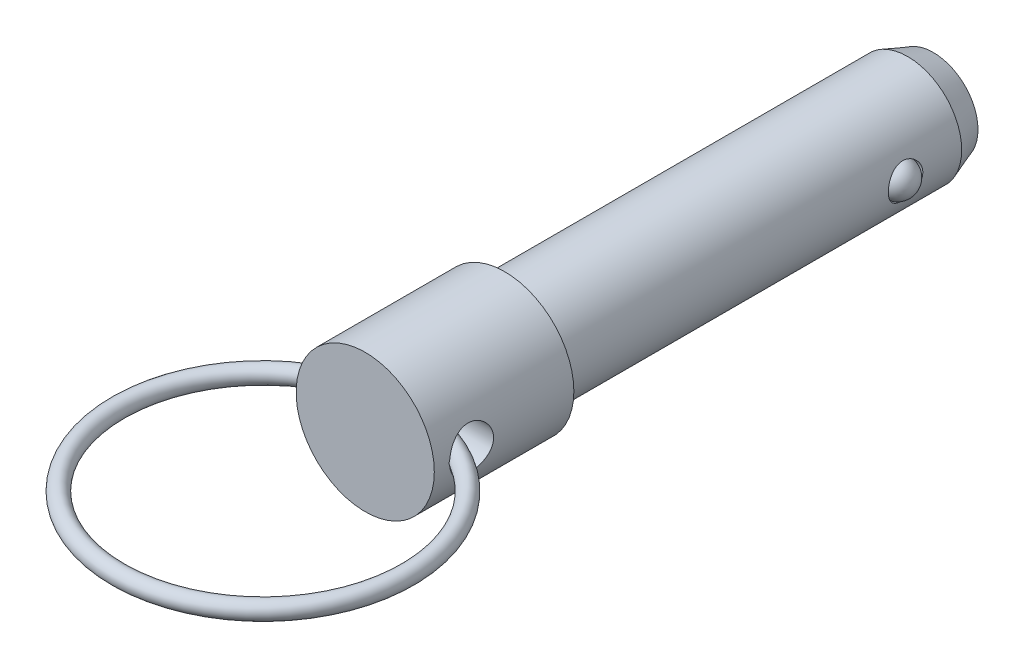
ISO-10303-21;
HEADER;
FILE_DESCRIPTION(('STEP AP214'),'2;1');
FILE_NAME('part.step','',(''),(''),'','','');
FILE_SCHEMA(('AUTOMOTIVE_DESIGN { 1 0 10303 214 1 1 1 1 }'));
ENDSEC;
DATA;
#1=APPLICATION_CONTEXT('core data for automotive mechanical design processes');
#2=APPLICATION_PROTOCOL_DEFINITION('international standard','automotive_design',2000,#1);
#3=PRODUCT_CONTEXT('',#1,'mechanical');
#4=PRODUCT('Part','Part','',(#3));
#5=PRODUCT_RELATED_PRODUCT_CATEGORY('part','',(#4));
#6=PRODUCT_DEFINITION_FORMATION('','',#4);
#7=PRODUCT_DEFINITION_CONTEXT('part definition',#1,'design');
#8=PRODUCT_DEFINITION('design','',#6,#7);
#9=PRODUCT_DEFINITION_SHAPE('','',#8);
#10=(LENGTH_UNIT() NAMED_UNIT(*) SI_UNIT(.MILLI.,.METRE.));
#11=(NAMED_UNIT(*) PLANE_ANGLE_UNIT() SI_UNIT($,.RADIAN.));
#12=(NAMED_UNIT(*) SI_UNIT($,.STERADIAN.) SOLID_ANGLE_UNIT());
#13=UNCERTAINTY_MEASURE_WITH_UNIT(LENGTH_MEASURE(1.E-05),#10,'distance_accuracy_value','');
#14=(GEOMETRIC_REPRESENTATION_CONTEXT(3) GLOBAL_UNCERTAINTY_ASSIGNED_CONTEXT((#13)) GLOBAL_UNIT_ASSIGNED_CONTEXT((#10,
#11,#12)) REPRESENTATION_CONTEXT('',''));
#15=CARTESIAN_POINT('',(0.,0.,0.));
#16=DIRECTION('',(0.,0.,1.));
#17=DIRECTION('',(1.,0.,0.));
#18=AXIS2_PLACEMENT_3D('',#15,#16,#17);
#19=CARTESIAN_POINT('',(7.9375,0.,9.398));
#20=DIRECTION('',(-1.,0.,0.));
#21=DIRECTION('',(0.,0.,-1.));
#22=AXIS2_PLACEMENT_3D('',#19,#20,#21);
#23=CYLINDRICAL_SURFACE('',#22,2.0193);
#24=CARTESIAN_POINT('',(-6.3502,0.292157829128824,11.3960531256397));
#25=CARTESIAN_POINT('',(-6.33446408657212,0.262361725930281,11.4004344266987));
#26=CARTESIAN_POINT('',(-6.32102794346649,0.23122551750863,11.4042829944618));
#27=CARTESIAN_POINT('',(-6.29925234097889,0.167152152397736,11.4106204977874));
#28=CARTESIAN_POINT('',(-6.29090461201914,0.134218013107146,11.413111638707));
#29=CARTESIAN_POINT('',(-6.2797291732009,0.0672091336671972,11.4164621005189));
#30=CARTESIAN_POINT('',(-6.27692077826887,0.0331308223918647,11.4173157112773));
#31=CARTESIAN_POINT('',(-6.2770260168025,-0.0350157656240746,11.4172838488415));
#32=CARTESIAN_POINT('',(-6.27993956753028,-0.069084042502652,11.4163984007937));
#33=CARTESIAN_POINT('',(-6.29126629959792,-0.135748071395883,11.4130038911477));
#34=CARTESIAN_POINT('',(-6.29960976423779,-0.168356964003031,11.4105154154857));
#35=CARTESIAN_POINT('',(-6.32127848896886,-0.231802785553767,11.404211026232));
#36=CARTESIAN_POINT('',(-6.33461136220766,-0.262636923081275,11.4003930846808));
#37=CARTESIAN_POINT('',(-6.3502,-0.292157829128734,11.3960531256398));
#38=B_SPLINE_CURVE_WITH_KNOTS('',3,(#24,#25,#26,#27,#28,#29,#30,#31,#32,#33,#34,#35,#36,#37),
.UNSPECIFIED.,.F.,.F.,(4,2,2,2,2,2,4),(0.,0.101899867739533,0.2036336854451,0.305721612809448,
0.407808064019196,0.508608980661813,0.609564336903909),.UNSPECIFIED.);
#39=CARTESIAN_POINT('',(-6.3438349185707,0.279747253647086,11.3978284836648));
#40=VERTEX_POINT('',#39);
#41=CARTESIAN_POINT('',(-6.3438349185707,-0.279747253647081,11.3978284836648));
#42=VERTEX_POINT('',#41);
#43=EDGE_CURVE('E40',#40,#42,#38,.T.);
#44=ORIENTED_EDGE('',*,*,#43,.F.);
#45=CARTESIAN_POINT('',(-6.35,0.,11.4173));
#46=CARTESIAN_POINT('',(-6.34999578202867,-0.110312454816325,11.417293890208));
#47=CARTESIAN_POINT('',(-6.34709412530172,-0.220741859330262,11.4082188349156));
#48=CARTESIAN_POINT('',(-6.3357852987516,-0.438477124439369,11.3722159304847));
#49=CARTESIAN_POINT('',(-6.3273687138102,-0.545777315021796,11.3452575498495));
#50=CARTESIAN_POINT('',(-6.30595235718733,-0.753914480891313,11.2744960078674));
#51=CARTESIAN_POINT('',(-6.29296259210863,-0.854765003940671,11.2307296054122));
#52=CARTESIAN_POINT('',(-6.26374009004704,-1.04765917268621,11.1277235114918));
#53=CARTESIAN_POINT('',(-6.247507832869,-1.13970411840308,11.0684861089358));
#54=CARTESIAN_POINT('',(-6.21293601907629,-1.31536123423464,10.9342184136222));
#55=CARTESIAN_POINT('',(-6.19454917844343,-1.39865352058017,10.8587818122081));
#56=CARTESIAN_POINT('',(-6.15801023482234,-1.55164747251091,10.6951184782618));
#57=CARTESIAN_POINT('',(-6.13985819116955,-1.62134576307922,10.606888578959));
#58=CARTESIAN_POINT('',(-6.1053372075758,-1.74691684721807,10.4173629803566));
#59=CARTESIAN_POINT('',(-6.08902613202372,-1.80238797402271,10.315789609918));
#60=CARTESIAN_POINT('',(-6.06074349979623,-1.89532725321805,10.104153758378));
#61=CARTESIAN_POINT('',(-6.0487707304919,-1.93280043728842,9.99409365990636));
#62=CARTESIAN_POINT('',(-6.03101341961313,-1.9875076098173,9.77220930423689));
#63=CARTESIAN_POINT('',(-6.02504825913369,-2.00533395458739,9.66054596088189));
#64=CARTESIAN_POINT('',(-6.01944581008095,-2.02209234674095,9.43566621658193));
#65=CARTESIAN_POINT('',(-6.01980677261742,-2.02102961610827,9.32245025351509));
#66=CARTESIAN_POINT('',(-6.02665663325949,-2.00050250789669,9.10261826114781));
#67=CARTESIAN_POINT('',(-6.03289303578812,-1.98179631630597,8.99592223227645));
#68=CARTESIAN_POINT('',(-6.05038018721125,-1.92774435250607,8.78726894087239));
#69=CARTESIAN_POINT('',(-6.06163151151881,-1.89239667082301,8.68531222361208));
#70=CARTESIAN_POINT('',(-6.08807105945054,-1.80553890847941,8.48724541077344));
#71=CARTESIAN_POINT('',(-6.1033159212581,-1.75379385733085,8.39124624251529));
#72=CARTESIAN_POINT('',(-6.13599834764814,-1.63577635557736,8.20905256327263));
#73=CARTESIAN_POINT('',(-6.15343637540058,-1.56950083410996,8.12286013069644));
#74=CARTESIAN_POINT('',(-6.18954615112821,-1.42061516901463,7.95845350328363));
#75=CARTESIAN_POINT('',(-6.2082373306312,-1.33738288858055,7.88080597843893));
#76=CARTESIAN_POINT('',(-6.24403204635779,-1.15881168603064,7.74040227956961));
#77=CARTESIAN_POINT('',(-6.26113489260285,-1.0634675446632,7.67765255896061));
#78=CARTESIAN_POINT('',(-6.29201953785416,-0.862230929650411,7.56842117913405));
#79=CARTESIAN_POINT('',(-6.30576997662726,-0.756251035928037,7.52209142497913));
#80=CARTESIAN_POINT('',(-6.32815272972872,-0.537579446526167,7.44816775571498));
#81=CARTESIAN_POINT('',(-6.3367955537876,-0.424902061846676,7.4205353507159));
#82=CARTESIAN_POINT('',(-6.34491251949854,-0.259333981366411,7.39474486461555));
#83=CARTESIAN_POINT('',(-6.3468148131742,-0.207677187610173,7.38873516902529));
#84=CARTESIAN_POINT('',(-6.34935954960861,-0.104022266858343,7.38071129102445));
#85=CARTESIAN_POINT('',(-6.35000198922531,-0.0520241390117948,7.37869711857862));
#86=CARTESIAN_POINT('',(-6.34999578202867,0.110312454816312,7.37870610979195));
#87=CARTESIAN_POINT('',(-6.34709412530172,0.22074185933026,7.38778116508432));
#88=CARTESIAN_POINT('',(-6.3357852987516,0.438477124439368,7.4237840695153));
#89=CARTESIAN_POINT('',(-6.3273687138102,0.545777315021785,7.45074245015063));
#90=CARTESIAN_POINT('',(-6.30595235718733,0.75391448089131,7.52150399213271));
#91=CARTESIAN_POINT('',(-6.29296259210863,0.854765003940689,7.56527039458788));
#92=CARTESIAN_POINT('',(-6.26374009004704,1.04765917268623,7.66827648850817));
#93=CARTESIAN_POINT('',(-6.247507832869,1.13970411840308,7.72751389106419));
#94=CARTESIAN_POINT('',(-6.21293601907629,1.31536123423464,7.86178158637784));
#95=CARTESIAN_POINT('',(-6.19454917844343,1.39865352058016,7.93721818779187));
#96=CARTESIAN_POINT('',(-6.15801023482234,1.55164747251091,8.10088152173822));
#97=CARTESIAN_POINT('',(-6.13985819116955,1.62134576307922,8.18911142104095));
#98=CARTESIAN_POINT('',(-6.1053372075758,1.74691684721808,8.37863701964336));
#99=CARTESIAN_POINT('',(-6.08902613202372,1.80238797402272,8.48021039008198));
#100=CARTESIAN_POINT('',(-6.06074349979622,1.89532725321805,8.69184624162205));
#101=CARTESIAN_POINT('',(-6.0487707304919,1.93280043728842,8.80190634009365));
#102=CARTESIAN_POINT('',(-6.03101341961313,1.9875076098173,9.02379069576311));
#103=CARTESIAN_POINT('',(-6.02504825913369,2.00533395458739,9.13545403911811));
#104=CARTESIAN_POINT('',(-6.01944581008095,2.02209234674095,9.36033378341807));
#105=CARTESIAN_POINT('',(-6.01980677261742,2.02102961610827,9.47354974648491));
#106=CARTESIAN_POINT('',(-6.02665663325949,2.00050250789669,9.69338173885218));
#107=CARTESIAN_POINT('',(-6.03289303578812,1.98179631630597,9.80007776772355));
#108=CARTESIAN_POINT('',(-6.05038018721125,1.92774435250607,10.0087310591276));
#109=CARTESIAN_POINT('',(-6.06163151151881,1.89239667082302,10.1106877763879));
#110=CARTESIAN_POINT('',(-6.08807105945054,1.80553890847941,10.3087545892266));
#111=CARTESIAN_POINT('',(-6.1033159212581,1.75379385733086,10.4047537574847));
#112=CARTESIAN_POINT('',(-6.13599834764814,1.63577635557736,10.5869474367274));
#113=CARTESIAN_POINT('',(-6.15343637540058,1.56950083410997,10.6731398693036));
#114=CARTESIAN_POINT('',(-6.18954615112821,1.42061516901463,10.8375464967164));
#115=CARTESIAN_POINT('',(-6.20823733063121,1.33738288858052,10.9151940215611));
#116=CARTESIAN_POINT('',(-6.2440320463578,1.15881168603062,11.0555977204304));
#117=CARTESIAN_POINT('',(-6.26113489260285,1.06346754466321,11.1183474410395));
#118=CARTESIAN_POINT('',(-6.29201953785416,0.862230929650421,11.227578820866));
#119=CARTESIAN_POINT('',(-6.30576997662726,0.756251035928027,11.2739085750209));
#120=CARTESIAN_POINT('',(-6.32815272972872,0.53757944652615,11.347832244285));
#121=CARTESIAN_POINT('',(-6.3367955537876,0.424902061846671,11.3754646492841));
#122=CARTESIAN_POINT('',(-6.34491251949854,0.25933398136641,11.4012551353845));
#123=CARTESIAN_POINT('',(-6.3468148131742,0.207677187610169,11.4072648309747));
#124=CARTESIAN_POINT('',(-6.34935954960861,0.104022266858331,11.4152887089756));
#125=CARTESIAN_POINT('',(-6.35000198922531,0.0520241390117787,11.4173028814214));
#126=CARTESIAN_POINT('',(-6.35,0.,11.4173));
#127=B_SPLINE_CURVE_WITH_KNOTS('',3,(#45,#46,#47,#48,#49,#50,#51,#52,#53,#54,#55,#56,#57,#58,
#59,#60,#61,#62,#63,#64,#65,#66,#67,#68,#69,#70,#71,#72,#73,#74,#75,#76,#77,#78,#79,#80,#81,#82,
#83,#84,#85,#86,#87,#88,#89,#90,#91,#92,#93,#94,#95,#96,#97,#98,#99,#100,#101,#102,#103,#104,
#105,#106,#107,#108,#109,#110,#111,#112,#113,#114,#115,#116,#117,#118,#119,#120,#121,#122,#123,
#124,#125,#126),.UNSPECIFIED.,.T.,.F.,(4,2,2,2,2,2,2,2,2,2,2,2,2,2,2,2,2,2,2,2,2,2,2,2,2,2,2,2,
2,2,2,2,2,2,2,2,2,2,2,2,4),(0.,0.330736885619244,0.662039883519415,0.992622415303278,
1.32315606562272,1.66322530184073,2.00337886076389,2.35228054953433,2.70108463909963,
3.03905724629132,3.37693642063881,3.70092724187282,4.02495524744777,4.35385413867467,
4.68282260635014,5.02727904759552,5.37188442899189,5.71959937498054,6.06659632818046,
6.22257380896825,6.37855167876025,6.70928856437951,7.04059156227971,7.37117409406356,
7.70170774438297,8.04177698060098,8.38193053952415,8.73083222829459,9.07963631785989,
9.41760892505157,9.75548809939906,10.0794789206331,10.403506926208,10.7324058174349,
11.0613742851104,11.4058307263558,11.7504361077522,12.0981510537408,12.4451480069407,
12.6011254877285,12.7571033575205),.UNSPECIFIED.);
#128=EDGE_CURVE('E66',#42,#40,#127,.T.);
#129=ORIENTED_EDGE('',*,*,#128,.F.);
#130=EDGE_LOOP('',(#44,#129));
#131=FACE_BOUND('',#130,.T.);
#132=CARTESIAN_POINT('',(6.3502,-0.292157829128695,11.3960531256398));
#133=CARTESIAN_POINT('',(6.33446408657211,-0.262361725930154,11.4004344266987));
#134=CARTESIAN_POINT('',(6.32102794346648,-0.231225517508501,11.4042829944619));
#135=CARTESIAN_POINT('',(6.29925234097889,-0.167152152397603,11.4106204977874));
#136=CARTESIAN_POINT('',(6.29090461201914,-0.134218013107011,11.413111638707));
#137=CARTESIAN_POINT('',(6.27972917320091,-0.0672091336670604,11.4164621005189));
#138=CARTESIAN_POINT('',(6.2769207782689,-0.0331308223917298,11.4173157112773));
#139=CARTESIAN_POINT('',(6.27702601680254,0.0350157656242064,11.4172838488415));
#140=CARTESIAN_POINT('',(6.27993956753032,0.0690840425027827,11.4163984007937));
#141=CARTESIAN_POINT('',(6.29126629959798,0.135748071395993,11.4130038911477));
#142=CARTESIAN_POINT('',(6.29960976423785,0.168356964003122,11.4105154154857));
#143=CARTESIAN_POINT('',(6.32127848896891,0.231802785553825,11.4042110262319));
#144=CARTESIAN_POINT('',(6.3346113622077,0.26263692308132,11.4003930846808));
#145=CARTESIAN_POINT('',(6.3502,0.292157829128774,11.3960531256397));
#146=B_SPLINE_CURVE_WITH_KNOTS('',3,(#132,#133,#134,#135,#136,#137,#138,#139,#140,#141,#142,
#143,#144,#145),.UNSPECIFIED.,.F.,.F.,(4,2,2,2,2,2,4),(0.,0.101899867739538,0.203633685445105,
0.305721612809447,0.40780806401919,0.508608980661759,0.609564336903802),.UNSPECIFIED.);
#147=CARTESIAN_POINT('',(6.3438349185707,-0.279747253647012,11.3978284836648));
#148=VERTEX_POINT('',#147);
#149=CARTESIAN_POINT('',(6.3438349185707,0.279747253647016,11.3978284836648));
#150=VERTEX_POINT('',#149);
#151=EDGE_CURVE('E33',#148,#150,#146,.T.);
#152=ORIENTED_EDGE('',*,*,#151,.F.);
#153=CARTESIAN_POINT('',(6.35,0.,7.3787));
#154=CARTESIAN_POINT('',(6.34999578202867,-0.110312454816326,7.37870610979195));
#155=CARTESIAN_POINT('',(6.34709412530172,-0.220741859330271,7.38778116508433));
#156=CARTESIAN_POINT('',(6.3357852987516,-0.438477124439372,7.4237840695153));
#157=CARTESIAN_POINT('',(6.32736871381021,-0.545777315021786,7.45074245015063));
#158=CARTESIAN_POINT('',(6.30595235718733,-0.753914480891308,7.52150399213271));
#159=CARTESIAN_POINT('',(6.29296259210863,-0.854765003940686,7.56527039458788));
#160=CARTESIAN_POINT('',(6.26374009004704,-1.04765917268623,7.66827648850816));
#161=CARTESIAN_POINT('',(6.24750783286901,-1.13970411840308,7.72751389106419));
#162=CARTESIAN_POINT('',(6.2129360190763,-1.31536123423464,7.86178158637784));
#163=CARTESIAN_POINT('',(6.19454917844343,-1.39865352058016,7.93721818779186));
#164=CARTESIAN_POINT('',(6.15801023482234,-1.5516474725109,8.10088152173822));
#165=CARTESIAN_POINT('',(6.13985819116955,-1.62134576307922,8.18911142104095));
#166=CARTESIAN_POINT('',(6.1053372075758,-1.74691684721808,8.37863701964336));
#167=CARTESIAN_POINT('',(6.08902613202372,-1.80238797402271,8.48021039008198));
#168=CARTESIAN_POINT('',(6.06074349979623,-1.89532725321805,8.69184624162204));
#169=CARTESIAN_POINT('',(6.04877073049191,-1.93280043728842,8.80190634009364));
#170=CARTESIAN_POINT('',(6.03101341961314,-1.9875076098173,9.02379069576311));
#171=CARTESIAN_POINT('',(6.02504825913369,-2.00533395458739,9.13545403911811));
#172=CARTESIAN_POINT('',(6.01944581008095,-2.02209234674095,9.36033378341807));
#173=CARTESIAN_POINT('',(6.01980677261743,-2.02102961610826,9.47354974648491));
#174=CARTESIAN_POINT('',(6.0266566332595,-2.00050250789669,9.69338173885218));
#175=CARTESIAN_POINT('',(6.03289303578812,-1.98179631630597,9.80007776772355));
#176=CARTESIAN_POINT('',(6.05038018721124,-1.92774435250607,10.0087310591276));
#177=CARTESIAN_POINT('',(6.06163151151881,-1.89239667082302,10.1106877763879));
#178=CARTESIAN_POINT('',(6.08807105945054,-1.80553890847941,10.3087545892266));
#179=CARTESIAN_POINT('',(6.1033159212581,-1.75379385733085,10.4047537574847));
#180=CARTESIAN_POINT('',(6.13599834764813,-1.63577635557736,10.5869474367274));
#181=CARTESIAN_POINT('',(6.15343637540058,-1.56950083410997,10.6731398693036));
#182=CARTESIAN_POINT('',(6.18954615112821,-1.42061516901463,10.8375464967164));
#183=CARTESIAN_POINT('',(6.2082373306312,-1.33738288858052,10.9151940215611));
#184=CARTESIAN_POINT('',(6.2440320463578,-1.15881168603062,11.0555977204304));
#185=CARTESIAN_POINT('',(6.26113489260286,-1.06346754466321,11.1183474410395));
#186=CARTESIAN_POINT('',(6.29201953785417,-0.86223092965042,11.227578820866));
#187=CARTESIAN_POINT('',(6.30576997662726,-0.756251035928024,11.2739085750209));
#188=CARTESIAN_POINT('',(6.32815272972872,-0.537579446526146,11.347832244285));
#189=CARTESIAN_POINT('',(6.33679555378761,-0.424902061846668,11.3754646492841));
#190=CARTESIAN_POINT('',(6.34491251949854,-0.25933398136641,11.4012551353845));
#191=CARTESIAN_POINT('',(6.3468148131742,-0.207677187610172,11.4072648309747));
#192=CARTESIAN_POINT('',(6.34935954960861,-0.104022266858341,11.4152887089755));
#193=CARTESIAN_POINT('',(6.35000198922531,-0.0520241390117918,11.4173028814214));
#194=CARTESIAN_POINT('',(6.34999578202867,0.110312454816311,11.417293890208));
#195=CARTESIAN_POINT('',(6.34709412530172,0.220741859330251,11.4082188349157));
#196=CARTESIAN_POINT('',(6.3357852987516,0.438477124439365,11.3722159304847));
#197=CARTESIAN_POINT('',(6.32736871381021,0.545777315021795,11.3452575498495));
#198=CARTESIAN_POINT('',(6.30595235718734,0.753914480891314,11.2744960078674));
#199=CARTESIAN_POINT('',(6.29296259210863,0.854765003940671,11.2307296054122));
#200=CARTESIAN_POINT('',(6.26374009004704,1.04765917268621,11.1277235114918));
#201=CARTESIAN_POINT('',(6.24750783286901,1.13970411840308,11.0684861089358));
#202=CARTESIAN_POINT('',(6.2129360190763,1.31536123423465,10.9342184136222));
#203=CARTESIAN_POINT('',(6.19454917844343,1.39865352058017,10.8587818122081));
#204=CARTESIAN_POINT('',(6.15801023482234,1.55164747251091,10.6951184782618));
#205=CARTESIAN_POINT('',(6.13985819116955,1.62134576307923,10.606888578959));
#206=CARTESIAN_POINT('',(6.1053372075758,1.74691684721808,10.4173629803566));
#207=CARTESIAN_POINT('',(6.08902613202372,1.80238797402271,10.315789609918));
#208=CARTESIAN_POINT('',(6.06074349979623,1.89532725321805,10.104153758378));
#209=CARTESIAN_POINT('',(6.04877073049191,1.93280043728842,9.99409365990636));
#210=CARTESIAN_POINT('',(6.03101341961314,1.9875076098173,9.77220930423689));
#211=CARTESIAN_POINT('',(6.02504825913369,2.0053339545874,9.66054596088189));
#212=CARTESIAN_POINT('',(6.01944581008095,2.02209234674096,9.43566621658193));
#213=CARTESIAN_POINT('',(6.01980677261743,2.02102961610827,9.32245025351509));
#214=CARTESIAN_POINT('',(6.0266566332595,2.00050250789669,9.10261826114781));
#215=CARTESIAN_POINT('',(6.03289303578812,1.98179631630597,8.99592223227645));
#216=CARTESIAN_POINT('',(6.05038018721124,1.92774435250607,8.78726894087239));
#217=CARTESIAN_POINT('',(6.06163151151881,1.89239667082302,8.68531222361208));
#218=CARTESIAN_POINT('',(6.08807105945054,1.80553890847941,8.48724541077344));
#219=CARTESIAN_POINT('',(6.1033159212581,1.75379385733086,8.39124624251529));
#220=CARTESIAN_POINT('',(6.13599834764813,1.63577635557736,8.20905256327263));
#221=CARTESIAN_POINT('',(6.15343637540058,1.56950083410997,8.12286013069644));
#222=CARTESIAN_POINT('',(6.18954615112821,1.42061516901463,7.95845350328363));
#223=CARTESIAN_POINT('',(6.2082373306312,1.33738288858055,7.88080597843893));
#224=CARTESIAN_POINT('',(6.24403204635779,1.15881168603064,7.74040227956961));
#225=CARTESIAN_POINT('',(6.26113489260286,1.0634675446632,7.67765255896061));
#226=CARTESIAN_POINT('',(6.29201953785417,0.862230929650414,7.56842117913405));
#227=CARTESIAN_POINT('',(6.30576997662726,0.756251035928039,7.52209142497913));
#228=CARTESIAN_POINT('',(6.32815272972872,0.537579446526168,7.44816775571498));
#229=CARTESIAN_POINT('',(6.33679555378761,0.424902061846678,7.4205353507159));
#230=CARTESIAN_POINT('',(6.34491251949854,0.25933398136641,7.39474486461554));
#231=CARTESIAN_POINT('',(6.3468148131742,0.207677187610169,7.38873516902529));
#232=CARTESIAN_POINT('',(6.34935954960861,0.104022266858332,7.38071129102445));
#233=CARTESIAN_POINT('',(6.35000198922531,0.0520241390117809,7.37869711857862));
#234=CARTESIAN_POINT('',(6.35,0.,7.3787));
#235=B_SPLINE_CURVE_WITH_KNOTS('',3,(#153,#154,#155,#156,#157,#158,#159,#160,#161,#162,#163,
#164,#165,#166,#167,#168,#169,#170,#171,#172,#173,#174,#175,#176,#177,#178,#179,#180,#181,#182,
#183,#184,#185,#186,#187,#188,#189,#190,#191,#192,#193,#194,#195,#196,#197,#198,#199,#200,#201,
#202,#203,#204,#205,#206,#207,#208,#209,#210,#211,#212,#213,#214,#215,#216,#217,#218,#219,#220,
#221,#222,#223,#224,#225,#226,#227,#228,#229,#230,#231,#232,#233,#234),.UNSPECIFIED.,.T.,.F.,(4,
2,2,2,2,2,2,2,2,2,2,2,2,2,2,2,2,2,2,2,2,2,2,2,2,2,2,2,2,2,2,2,2,2,2,2,2,2,2,2,4),(0.,
0.330736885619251,0.662039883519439,0.992622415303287,1.3231560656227,1.66322530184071,
2.00337886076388,2.35228054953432,2.70108463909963,3.0390572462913,3.37693642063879,
3.7009272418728,4.02495524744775,4.35385413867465,4.68282260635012,5.02727904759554,
5.37188442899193,5.71959937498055,6.06659632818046,6.22257380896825,6.37855167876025,
6.70928856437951,7.04059156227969,7.37117409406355,7.70170774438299,8.041776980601,
8.38193053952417,8.7308322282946,9.0796363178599,9.41760892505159,9.75548809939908,
10.0794789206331,10.403506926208,10.7324058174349,11.0613742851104,11.4058307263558,
11.7504361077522,12.0981510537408,12.4451480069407,12.6011254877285,12.7571033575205),.UNSPECIFIED.);
#236=EDGE_CURVE('E62',#150,#148,#235,.T.);
#237=ORIENTED_EDGE('',*,*,#236,.F.);
#238=EDGE_LOOP('',(#152,#237));
#239=FACE_BOUND('',#238,.T.);
#240=ADVANCED_FACE('F14',(#131,#239),#23,.F.);
#241=CARTESIAN_POINT('',(0.,0.,-34.39922));
#242=DIRECTION('',(0.,0.,-1.));
#243=DIRECTION('',(1.,0.,0.));
#244=AXIS2_PLACEMENT_3D('',#241,#242,#243);
#245=CYLINDRICAL_SURFACE('',#244,6.35);
#246=ORIENTED_EDGE('',*,*,#236,.T.);
#247=CARTESIAN_POINT('',(6.34665582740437,-0.20605782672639,9.66636736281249));
#248=CARTESIAN_POINT('',(6.34528498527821,-0.248279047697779,9.67828523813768));
#249=CARTESIAN_POINT('',(6.34352249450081,-0.289459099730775,9.69386090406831));
#250=CARTESIAN_POINT('',(6.33942011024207,-0.368543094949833,9.73178017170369));
#251=CARTESIAN_POINT('',(6.33708008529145,-0.406446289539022,9.75412531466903));
#252=CARTESIAN_POINT('',(6.33209241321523,-0.47789990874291,9.80476660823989));
#253=CARTESIAN_POINT('',(6.32944535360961,-0.511458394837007,9.83305147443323));
#254=CARTESIAN_POINT('',(6.32412241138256,-0.573540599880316,9.89467297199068));
#255=CARTESIAN_POINT('',(6.32144652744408,-0.602064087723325,9.92800983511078));
#256=CARTESIAN_POINT('',(6.31623478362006,-0.654523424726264,10.0000464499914));
#257=CARTESIAN_POINT('',(6.31370785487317,-0.678248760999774,10.0388997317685));
#258=CARTESIAN_POINT('',(6.30914807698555,-0.719430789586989,10.1198151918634));
#259=CARTESIAN_POINT('',(6.30711537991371,-0.736885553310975,10.1618783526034));
#260=CARTESIAN_POINT('',(6.30356963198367,-0.766652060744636,10.2517585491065));
#261=CARTESIAN_POINT('',(6.3021147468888,-0.778407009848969,10.2997618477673));
#262=CARTESIAN_POINT('',(6.30009638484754,-0.794575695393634,10.3969997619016));
#263=CARTESIAN_POINT('',(6.2995332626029,-0.798986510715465,10.4462348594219));
#264=CARTESIAN_POINT('',(6.29930439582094,-0.800791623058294,10.5499764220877));
#265=CARTESIAN_POINT('',(6.29973840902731,-0.797405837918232,10.6044969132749));
#266=CARTESIAN_POINT('',(6.30162771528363,-0.782332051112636,10.7123814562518));
#267=CARTESIAN_POINT('',(6.30308376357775,-0.770637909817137,10.7657446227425));
#268=CARTESIAN_POINT('',(6.30699495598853,-0.737976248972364,10.8743575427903));
#269=CARTESIAN_POINT('',(6.30952256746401,-0.716323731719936,10.9294001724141));
#270=CARTESIAN_POINT('',(6.31524450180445,-0.663986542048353,11.0349896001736));
#271=CARTESIAN_POINT('',(6.31843852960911,-0.633305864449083,11.0855383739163));
#272=CARTESIAN_POINT('',(6.32446092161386,-0.569663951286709,11.1714846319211));
#273=CARTESIAN_POINT('',(6.3272488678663,-0.538153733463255,11.2079604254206));
#274=CARTESIAN_POINT('',(6.33270636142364,-0.469583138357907,11.2752665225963));
#275=CARTESIAN_POINT('',(6.3353760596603,-0.432530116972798,11.3061041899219));
#276=CARTESIAN_POINT('',(6.33987873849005,-0.359908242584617,11.3561064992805));
#277=CARTESIAN_POINT('',(6.34177713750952,-0.32509230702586,11.3763560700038));
#278=CARTESIAN_POINT('',(6.34507913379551,-0.252556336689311,11.4108259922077));
#279=CARTESIAN_POINT('',(6.34648300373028,-0.214837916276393,11.4250496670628));
#280=CARTESIAN_POINT('',(6.34863622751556,-0.137224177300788,11.446638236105));
#281=CARTESIAN_POINT('',(6.34938200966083,-0.0973182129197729,11.4539657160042));
#282=CARTESIAN_POINT('',(6.35010496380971,-0.0168334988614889,11.4610716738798));
#283=CARTESIAN_POINT('',(6.35008242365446,0.0237449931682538,11.4608529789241));
#284=CARTESIAN_POINT('',(6.34931136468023,0.100393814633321,11.4532686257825));
#285=CARTESIAN_POINT('',(6.34863038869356,0.136533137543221,11.4465678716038));
#286=CARTESIAN_POINT('',(6.3467164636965,0.207223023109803,11.4274006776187));
#287=CARTESIAN_POINT('',(6.34548344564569,0.241773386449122,11.4149335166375));
#288=CARTESIAN_POINT('',(6.34254165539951,0.309606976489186,11.3844132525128));
#289=CARTESIAN_POINT('',(6.34081891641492,0.34281422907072,11.3661941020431));
#290=CARTESIAN_POINT('',(6.3370736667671,0.40621157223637,11.3251453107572));
#291=CARTESIAN_POINT('',(6.33505103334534,0.436400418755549,11.3023137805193));
#292=CARTESIAN_POINT('',(6.33055131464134,0.497695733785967,11.2491439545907));
#293=CARTESIAN_POINT('',(6.32805141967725,0.528268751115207,11.2181940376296));
#294=CARTESIAN_POINT('',(6.32308163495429,0.584759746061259,11.1523092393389));
#295=CARTESIAN_POINT('',(6.32061176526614,0.610674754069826,11.1173718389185));
#296=CARTESIAN_POINT('',(6.31545647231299,0.662038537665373,11.0376631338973));
#297=CARTESIAN_POINT('',(6.31281513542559,0.686522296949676,10.9922657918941));
#298=CARTESIAN_POINT('',(6.30810097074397,0.728566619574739,10.8983369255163));
#299=CARTESIAN_POINT('',(6.30602851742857,0.746122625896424,10.8498033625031));
#300=CARTESIAN_POINT('',(6.30243933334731,0.77589667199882,10.7442183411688));
#301=CARTESIAN_POINT('',(6.30103001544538,0.787122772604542,10.6868803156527));
#302=CARTESIAN_POINT('',(6.29940721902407,0.800007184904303,10.5710986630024));
#303=CARTESIAN_POINT('',(6.29919407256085,0.801662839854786,10.5126547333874));
#304=CARTESIAN_POINT('',(6.30005021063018,0.794909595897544,10.3956729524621));
#305=CARTESIAN_POINT('',(6.30113381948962,0.786388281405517,10.3371413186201));
#306=CARTESIAN_POINT('',(6.30452399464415,0.758730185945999,10.2226628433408));
#307=CARTESIAN_POINT('',(6.30682981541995,0.739599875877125,10.1667144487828));
#308=CARTESIAN_POINT('',(6.31212037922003,0.692916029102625,10.0644672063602));
#309=CARTESIAN_POINT('',(6.31502617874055,0.666266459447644,10.0177527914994));
#310=CARTESIAN_POINT('',(6.32122790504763,0.604592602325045,9.93024699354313));
#311=CARTESIAN_POINT('',(6.32452352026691,0.569574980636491,9.88945093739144));
#312=CARTESIAN_POINT('',(6.33066231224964,0.496394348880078,9.81967919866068));
#313=CARTESIAN_POINT('',(6.3335154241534,0.4589992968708,9.78989736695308));
#314=CARTESIAN_POINT('',(6.33878167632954,0.379383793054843,9.73763453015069));
#315=CARTESIAN_POINT('',(6.34119502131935,0.337165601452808,9.71515012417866));
#316=CARTESIAN_POINT('',(6.34510608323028,0.252558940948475,9.67976956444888));
#317=CARTESIAN_POINT('',(6.3466587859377,0.210419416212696,9.66628201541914));
#318=CARTESIAN_POINT('',(6.34892624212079,0.124425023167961,9.64681261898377));
#319=CARTESIAN_POINT('',(6.34964132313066,0.0805708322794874,9.6408278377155));
#320=CARTESIAN_POINT('',(6.35013003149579,-0.00429887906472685,9.63672685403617));
#321=CARTESIAN_POINT('',(6.3499683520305,-0.045288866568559,9.63806999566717));
#322=CARTESIAN_POINT('',(6.34886964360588,-0.126506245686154,9.64734016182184));
#323=CARTESIAN_POINT('',(6.34793260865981,-0.166733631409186,9.65526723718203));
#324=CARTESIAN_POINT('',(6.34665582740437,-0.20605782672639,9.66636736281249));
#325=B_SPLINE_CURVE_WITH_KNOTS('',3,(#247,#248,#249,#250,#251,#252,#253,#254,#255,#256,#257,
#258,#259,#260,#261,#262,#263,#264,#265,#266,#267,#268,#269,#270,#271,#272,#273,#274,#275,#276,
#277,#278,#279,#280,#281,#282,#283,#284,#285,#286,#287,#288,#289,#290,#291,#292,#293,#294,#295,
#296,#297,#298,#299,#300,#301,#302,#303,#304,#305,#306,#307,#308,#309,#310,#311,#312,#313,#314,
#315,#316,#317,#318,#319,#320,#321,#322,#323,#324),.UNSPECIFIED.,.T.,.F.,(4,2,2,2,2,2,2,2,2,2,2,
2,2,2,2,2,2,2,2,2,2,2,2,2,2,2,2,2,2,2,2,2,2,2,2,2,2,2,4),(0.,0.13152381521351,0.263077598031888,
0.394383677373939,0.525695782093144,0.661900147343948,0.798146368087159,0.945864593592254,
1.09364155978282,1.25683680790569,1.42015277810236,1.59693202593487,1.77363316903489,
1.91791685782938,2.06201073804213,2.18247669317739,2.3028761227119,2.4239250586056,
2.54492864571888,2.65470676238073,2.76449861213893,2.87780525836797,2.99115841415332,
3.12140054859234,3.25172542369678,3.40605418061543,3.56048428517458,3.73501068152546,
3.90958552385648,4.08610670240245,4.26252033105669,4.42319186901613,4.58373584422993,
4.72664586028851,4.86948917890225,5.00164792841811,5.13375498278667,5.25625329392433,
5.37875255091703),.UNSPECIFIED.);
#326=EDGE_CURVE('E27',#148,#150,#325,.T.);
#327=ORIENTED_EDGE('',*,*,#326,.T.);
#328=EDGE_LOOP('',(#246,#327));
#329=FACE_BOUND('',#328,.T.);
#330=CARTESIAN_POINT('',(0.,0.,12.8270000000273));
#331=DIRECTION('',(0.,0.,-1.));
#332=DIRECTION('',(1.,0.,0.));
#333=AXIS2_PLACEMENT_3D('',#330,#331,#332);
#334=CIRCLE('',#333,6.34999999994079);
#335=CARTESIAN_POINT('',(6.34999999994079,0.,12.8270000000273));
#336=VERTEX_POINT('',#335);
#337=EDGE_CURVE('E71',#336,#336,#334,.T.);
#338=ORIENTED_EDGE('',*,*,#337,.T.);
#339=EDGE_LOOP('',(#338));
#340=FACE_BOUND('',#339,.T.);
#341=CARTESIAN_POINT('',(0.,0.,1.16504028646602E-11));
#342=DIRECTION('',(0.,0.,-1.));
#343=DIRECTION('',(1.,0.,0.));
#344=AXIS2_PLACEMENT_3D('',#341,#342,#343);
#345=CIRCLE('',#344,6.34999999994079);
#346=CARTESIAN_POINT('',(6.34999999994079,0.,1.1650123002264E-11));
#347=VERTEX_POINT('',#346);
#348=EDGE_CURVE('E279',#347,#347,#345,.T.);
#349=ORIENTED_EDGE('',*,*,#348,.F.);
#350=EDGE_LOOP('',(#349));
#351=FACE_BOUND('',#350,.T.);
#352=ORIENTED_EDGE('',*,*,#128,.T.);
#353=CARTESIAN_POINT('',(-6.34665582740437,-0.206057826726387,9.66636736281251));
#354=CARTESIAN_POINT('',(-6.34797934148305,-0.165285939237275,9.65485950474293));
#355=CARTESIAN_POINT('',(-6.34893816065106,-0.123532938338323,9.64675937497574));
#356=CARTESIAN_POINT('',(-6.35001869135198,-0.0392395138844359,9.63764831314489));
#357=CARTESIAN_POINT('',(-6.35014017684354,0.00330111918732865,9.63663929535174));
#358=CARTESIAN_POINT('',(-6.34953206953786,0.0879394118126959,9.64174776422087));
#359=CARTESIAN_POINT('',(-6.34880260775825,0.13003713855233,9.64786415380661));
#360=CARTESIAN_POINT('',(-6.34657447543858,0.212600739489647,9.66701677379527));
#361=CARTESIAN_POINT('',(-6.34507584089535,0.253066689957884,9.68005268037));
#362=CARTESIAN_POINT('',(-6.34146900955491,0.331381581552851,9.7126623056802));
#363=CARTESIAN_POINT('',(-6.33935898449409,0.369222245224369,9.73225566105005));
#364=CARTESIAN_POINT('',(-6.33475813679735,0.441182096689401,9.77733154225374));
#365=CARTESIAN_POINT('',(-6.33226728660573,0.47530101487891,9.80281449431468));
#366=CARTESIAN_POINT('',(-6.32708436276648,0.539990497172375,9.85971055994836));
#367=CARTESIAN_POINT('',(-6.32438850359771,0.570424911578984,9.89127784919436));
#368=CARTESIAN_POINT('',(-6.3191381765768,0.625916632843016,9.95882994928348));
#369=CARTESIAN_POINT('',(-6.31658374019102,0.650972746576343,9.9948157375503));
#370=CARTESIAN_POINT('',(-6.31170869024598,0.696703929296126,10.0724886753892));
#371=CARTESIAN_POINT('',(-6.30941195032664,0.71701708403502,10.1143899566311));
#372=CARTESIAN_POINT('',(-6.30545539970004,0.751016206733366,10.2008200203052));
#373=CARTESIAN_POINT('',(-6.30379582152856,0.764699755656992,10.245349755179));
#374=CARTESIAN_POINT('',(-6.30112261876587,0.78643932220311,10.3401349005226));
#375=CARTESIAN_POINT('',(-6.30018307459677,0.793856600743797,10.3905385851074));
#376=CARTESIAN_POINT('',(-6.29927265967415,0.801046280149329,10.4918905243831));
#377=CARTESIAN_POINT('',(-6.29930218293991,0.800815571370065,10.5428389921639));
#378=CARTESIAN_POINT('',(-6.3003424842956,0.792594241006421,10.6494235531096));
#379=CARTESIAN_POINT('',(-6.30145478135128,0.783800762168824,10.7049973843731));
#380=CARTESIAN_POINT('',(-6.30465473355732,0.757628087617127,10.8140964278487));
#381=CARTESIAN_POINT('',(-6.30674324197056,0.740241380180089,10.8676198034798));
#382=CARTESIAN_POINT('',(-6.31179783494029,0.695872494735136,10.9743734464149));
#383=CARTESIAN_POINT('',(-6.31480965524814,0.66836998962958,11.0273869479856));
#384=CARTESIAN_POINT('',(-6.32125797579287,0.604341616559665,11.127620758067));
#385=CARTESIAN_POINT('',(-6.32469393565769,0.567827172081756,11.1748482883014));
#386=CARTESIAN_POINT('',(-6.33064540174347,0.496358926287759,11.2504526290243));
#387=CARTESIAN_POINT('',(-6.33317742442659,0.463272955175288,11.2805972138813));
#388=CARTESIAN_POINT('',(-6.33795112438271,0.392589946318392,11.3350975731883));
#389=CARTESIAN_POINT('',(-6.34019298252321,0.354995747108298,11.3594569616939));
#390=CARTESIAN_POINT('',(-6.34414022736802,0.275631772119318,11.4012144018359));
#391=CARTESIAN_POINT('',(-6.34584084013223,0.233828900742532,11.418550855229));
#392=CARTESIAN_POINT('',(-6.3484301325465,0.147595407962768,11.4446164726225));
#393=CARTESIAN_POINT('',(-6.34931975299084,0.103167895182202,11.4533556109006));
#394=CARTESIAN_POINT('',(-6.35008514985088,0.0199378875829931,11.4608753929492));
#395=CARTESIAN_POINT('',(-6.35008843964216,-0.0187536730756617,11.4609085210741));
#396=CARTESIAN_POINT('',(-6.34939746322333,-0.0955170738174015,11.4541183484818));
#397=CARTESIAN_POINT('',(-6.34870331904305,-0.13358902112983,11.4472962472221));
#398=CARTESIAN_POINT('',(-6.34675486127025,-0.206035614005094,11.4277870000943));
#399=CARTESIAN_POINT('',(-6.34553149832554,-0.240499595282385,11.4154227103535));
#400=CARTESIAN_POINT('',(-6.34265636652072,-0.307121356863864,11.3856122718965));
#401=CARTESIAN_POINT('',(-6.34100449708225,-0.339278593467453,11.3681649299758));
#402=CARTESIAN_POINT('',(-6.33723692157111,-0.403825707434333,11.3269948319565));
#403=CARTESIAN_POINT('',(-6.33509154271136,-0.435925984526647,11.3028229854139));
#404=CARTESIAN_POINT('',(-6.33064272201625,-0.496369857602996,11.250192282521));
#405=CARTESIAN_POINT('',(-6.32833919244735,-0.524711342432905,11.2217310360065));
#406=CARTESIAN_POINT('',(-6.32334030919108,-0.582098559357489,11.1560085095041));
#407=CARTESIAN_POINT('',(-6.3206477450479,-0.61038158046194,11.1180812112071));
#408=CARTESIAN_POINT('',(-6.31552631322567,-0.661272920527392,11.0385798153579));
#409=CARTESIAN_POINT('',(-6.31309762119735,-0.683877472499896,10.9970033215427));
#410=CARTESIAN_POINT('',(-6.30833642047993,-0.726588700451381,10.9038901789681));
#411=CARTESIAN_POINT('',(-6.30608942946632,-0.74562876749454,10.8518572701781));
#412=CARTESIAN_POINT('',(-6.30248979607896,-0.775466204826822,10.7454330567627));
#413=CARTESIAN_POINT('',(-6.30113765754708,-0.786258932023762,10.69104044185));
#414=CARTESIAN_POINT('',(-6.29944352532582,-0.799728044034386,10.5770263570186));
#415=CARTESIAN_POINT('',(-6.29918591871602,-0.801726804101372,10.5173211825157));
#416=CARTESIAN_POINT('',(-6.30000525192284,-0.795264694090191,10.3984664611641));
#417=CARTESIAN_POINT('',(-6.30108195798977,-0.786805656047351,10.3393168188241));
#418=CARTESIAN_POINT('',(-6.30440515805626,-0.759704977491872,10.2262823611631));
#419=CARTESIAN_POINT('',(-6.30659553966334,-0.741549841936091,10.1722805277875));
#420=CARTESIAN_POINT('',(-6.31185428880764,-0.695364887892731,10.068707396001));
#421=CARTESIAN_POINT('',(-6.31492202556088,-0.667342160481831,10.0191329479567));
#422=CARTESIAN_POINT('',(-6.32113146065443,-0.60551542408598,9.93168975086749));
#423=CARTESIAN_POINT('',(-6.32422841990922,-0.572678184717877,9.89313380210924));
#424=CARTESIAN_POINT('',(-6.33035789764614,-0.500375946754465,9.82285661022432));
#425=CARTESIAN_POINT('',(-6.3333904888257,-0.460918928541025,9.79112724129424));
#426=CARTESIAN_POINT('',(-6.33833786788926,-0.38606914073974,9.74204682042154));
#427=CARTESIAN_POINT('',(-6.34035098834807,-0.351739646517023,9.72306715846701));
#428=CARTESIAN_POINT('',(-6.34389840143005,-0.280571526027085,9.6905451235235));
#429=CARTESIAN_POINT('',(-6.3454328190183,-0.243733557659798,9.67700133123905));
#430=CARTESIAN_POINT('',(-6.34665582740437,-0.206057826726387,9.66636736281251));
#431=B_SPLINE_CURVE_WITH_KNOTS('',3,(#353,#354,#355,#356,#357,#358,#359,#360,#361,#362,#363,
#364,#365,#366,#367,#368,#369,#370,#371,#372,#373,#374,#375,#376,#377,#378,#379,#380,#381,#382,
#383,#384,#385,#386,#387,#388,#389,#390,#391,#392,#393,#394,#395,#396,#397,#398,#399,#400,#401,
#402,#403,#404,#405,#406,#407,#408,#409,#410,#411,#412,#413,#414,#415,#416,#417,#418,#419,#420,
#421,#422,#423,#424,#425,#426,#427,#428,#429,#430),.UNSPECIFIED.,.T.,.F.,(4,2,2,2,2,2,2,2,2,2,2,
2,2,2,2,2,2,2,2,2,2,2,2,2,2,2,2,2,2,2,2,2,2,2,2,2,2,2,4),(0.,0.127017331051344,
0.254068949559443,0.381101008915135,0.508127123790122,0.635537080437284,0.76295626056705,
0.894175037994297,1.0254228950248,1.16470220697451,1.30403230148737,1.45626942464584,
1.60856844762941,1.7766734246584,1.94492561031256,2.12343441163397,2.30171808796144,
2.43568966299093,2.56957732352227,2.70461513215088,2.83949608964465,2.95496006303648,
3.07040383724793,3.17985460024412,3.28933107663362,3.40960027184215,3.52993673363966,
3.6715656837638,3.81328834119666,3.97894617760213,4.14469720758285,4.32301887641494,
4.50130931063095,4.67139503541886,4.84135878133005,4.99274402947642,5.14394807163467,
5.26135056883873,5.3787223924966),.UNSPECIFIED.);
#432=EDGE_CURVE('E9',#40,#42,#431,.T.);
#433=ORIENTED_EDGE('',*,*,#432,.T.);
#434=EDGE_LOOP('',(#352,#433));
#435=FACE_BOUND('',#434,.T.);
#436=ADVANCED_FACE('F64',(#329,#340,#351,#435),#245,.T.);
#437=CARTESIAN_POINT('',(0.,0.,-5.));
#438=DIRECTION('',(0.,0.,1.));
#439=DIRECTION('',(-0.810321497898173,-0.585985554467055,0.));
#440=AXIS2_PLACEMENT_3D('',#437,#438,#439);
#441=CYLINDRICAL_SURFACE('',#440,4.95554);
#442=CARTESIAN_POINT('',(0.,0.,0.));
#443=DIRECTION('',(0.,0.,-1.));
#444=DIRECTION('',(0.810321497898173,0.585985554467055,0.));
#445=AXIS2_PLACEMENT_3D('',#442,#443,#444);
#446=CIRCLE('',#445,4.95554);
#447=CARTESIAN_POINT('',(4.0155805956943,2.90387485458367,0.));
#448=VERTEX_POINT('',#447);
#449=EDGE_CURVE('E60',#448,#448,#446,.T.);
#450=ORIENTED_EDGE('',*,*,#449,.T.);
#451=EDGE_LOOP('',(#450));
#452=FACE_BOUND('',#451,.T.);
#453=CARTESIAN_POINT('',(4.95554,0.,-30.29332));
#454=CARTESIAN_POINT('',(4.95553666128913,0.0866897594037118,-30.2933248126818));
#455=CARTESIAN_POINT('',(4.95324045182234,0.17347102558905,-30.3004537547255));
#456=CARTESIAN_POINT('',(4.94429120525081,0.344577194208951,-30.3287349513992));
#457=CARTESIAN_POINT('',(4.93763074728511,0.428897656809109,-30.349911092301));
#458=CARTESIAN_POINT('',(4.92068254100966,0.592457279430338,-30.4054922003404));
#459=CARTESIAN_POINT('',(4.91040277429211,0.671707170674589,-30.4398680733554));
#460=CARTESIAN_POINT('',(4.88727518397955,0.823288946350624,-30.5207700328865));
#461=CARTESIAN_POINT('',(4.87442773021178,0.89562182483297,-30.5672943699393));
#462=CARTESIAN_POINT('',(4.84705629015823,1.0336940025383,-30.6727644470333));
#463=CARTESIAN_POINT('',(4.83249427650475,1.09917878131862,-30.7320335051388));
#464=CARTESIAN_POINT('',(4.80355063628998,1.21947281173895,-30.860625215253));
#465=CARTESIAN_POINT('',(4.78916905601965,1.27427937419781,-30.9299503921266));
#466=CARTESIAN_POINT('',(4.76180578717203,1.37305673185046,-31.0789084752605));
#467=CARTESIAN_POINT('',(4.74887057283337,1.41670648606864,-31.1587636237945));
#468=CARTESIAN_POINT('',(4.72643603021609,1.48985016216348,-31.3251622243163));
#469=CARTESIAN_POINT('',(4.7169357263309,1.51934810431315,-31.4117037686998));
#470=CARTESIAN_POINT('',(4.70284355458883,1.56241523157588,-31.5861508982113));
#471=CARTESIAN_POINT('',(4.69810668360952,1.5764562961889,-31.6739279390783));
#472=CARTESIAN_POINT('',(4.69364777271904,1.58968567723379,-31.8507099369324));
#473=CARTESIAN_POINT('',(4.69392432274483,1.58887816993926,-31.9397145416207));
#474=CARTESIAN_POINT('',(4.69933334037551,1.57280144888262,-32.1124771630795));
#475=CARTESIAN_POINT('',(4.70426240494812,1.55813797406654,-32.1962990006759));
#476=CARTESIAN_POINT('',(4.71808978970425,1.51574977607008,-32.3602240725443));
#477=CARTESIAN_POINT('',(4.72698857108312,1.48802353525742,-32.4403268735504));
#478=CARTESIAN_POINT('',(4.74790477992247,1.41987997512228,-32.5959596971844));
#479=CARTESIAN_POINT('',(4.75996755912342,1.3792761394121,-32.6714016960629));
#480=CARTESIAN_POINT('',(4.7858316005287,1.28666181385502,-32.8145932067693));
#481=CARTESIAN_POINT('',(4.7996332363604,1.23464887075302,-32.8823410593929));
#482=CARTESIAN_POINT('',(4.82822844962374,1.11775274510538,-33.0116328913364));
#483=CARTESIAN_POINT('',(4.84303789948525,1.05237301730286,-33.0727252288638));
#484=CARTESIAN_POINT('',(4.87140539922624,0.912085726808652,-33.1832136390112));
#485=CARTESIAN_POINT('',(4.88496290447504,0.837174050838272,-33.2326046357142));
#486=CARTESIAN_POINT('',(4.90945634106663,0.679024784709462,-33.3186171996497));
#487=CARTESIAN_POINT('',(4.92036685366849,0.595716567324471,-33.3551163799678));
#488=CARTESIAN_POINT('',(4.9381364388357,0.423802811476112,-33.4133833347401));
#489=CARTESIAN_POINT('',(4.94500382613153,0.335208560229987,-33.435181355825));
#490=CARTESIAN_POINT('',(4.95147275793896,0.204839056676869,-33.4555865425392));
#491=CARTESIAN_POINT('',(4.95299354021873,0.164038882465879,-33.4603558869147));
#492=CARTESIAN_POINT('',(4.95502795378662,0.0821659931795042,-33.4667237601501));
#493=CARTESIAN_POINT('',(4.95554158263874,0.0410932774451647,-33.4683222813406));
#494=CARTESIAN_POINT('',(4.95553666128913,-0.0866897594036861,-33.4683151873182));
#495=CARTESIAN_POINT('',(4.95324045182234,-0.17347102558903,-33.4611862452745));
#496=CARTESIAN_POINT('',(4.94429120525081,-0.344577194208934,-33.4329050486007));
#497=CARTESIAN_POINT('',(4.93763074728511,-0.428897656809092,-33.4117289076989));
#498=CARTESIAN_POINT('',(4.92068254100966,-0.592457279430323,-33.3561477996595));
#499=CARTESIAN_POINT('',(4.91040277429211,-0.671707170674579,-33.3217719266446));
#500=CARTESIAN_POINT('',(4.88727518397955,-0.823288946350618,-33.2408699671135));
#501=CARTESIAN_POINT('',(4.87442773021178,-0.895621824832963,-33.1943456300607));
#502=CARTESIAN_POINT('',(4.84705629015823,-1.03369400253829,-33.0888755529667));
#503=CARTESIAN_POINT('',(4.83249427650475,-1.09917878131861,-33.0296064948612));
#504=CARTESIAN_POINT('',(4.80355063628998,-1.21947281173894,-32.901014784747));
#505=CARTESIAN_POINT('',(4.78916905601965,-1.27427937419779,-32.8316896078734));
#506=CARTESIAN_POINT('',(4.76180578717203,-1.37305673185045,-32.6827315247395));
#507=CARTESIAN_POINT('',(4.74887057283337,-1.41670648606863,-32.6028763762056));
#508=CARTESIAN_POINT('',(4.72643603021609,-1.48985016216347,-32.4364777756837));
#509=CARTESIAN_POINT('',(4.7169357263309,-1.51934810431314,-32.3499362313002));
#510=CARTESIAN_POINT('',(4.70284355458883,-1.56241523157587,-32.1754891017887));
#511=CARTESIAN_POINT('',(4.69810668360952,-1.57645629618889,-32.0877120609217));
#512=CARTESIAN_POINT('',(4.69364777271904,-1.58968567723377,-31.9109300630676));
#513=CARTESIAN_POINT('',(4.69392432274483,-1.58887816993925,-31.8219254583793));
#514=CARTESIAN_POINT('',(4.69933334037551,-1.57280144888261,-31.6491628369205));
#515=CARTESIAN_POINT('',(4.70426240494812,-1.55813797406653,-31.5653409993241));
#516=CARTESIAN_POINT('',(4.71808978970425,-1.51574977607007,-31.4014159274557));
#517=CARTESIAN_POINT('',(4.72698857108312,-1.48802353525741,-31.3213131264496));
#518=CARTESIAN_POINT('',(4.74790477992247,-1.41987997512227,-31.1656803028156));
#519=CARTESIAN_POINT('',(4.75996755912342,-1.3792761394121,-31.0902383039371));
#520=CARTESIAN_POINT('',(4.7858316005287,-1.28666181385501,-30.9470467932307));
#521=CARTESIAN_POINT('',(4.7996332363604,-1.23464887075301,-30.8792989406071));
#522=CARTESIAN_POINT('',(4.82822844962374,-1.11775274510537,-30.7500071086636));
#523=CARTESIAN_POINT('',(4.84303789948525,-1.05237301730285,-30.6889147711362));
#524=CARTESIAN_POINT('',(4.87140539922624,-0.912085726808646,-30.5784263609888));
#525=CARTESIAN_POINT('',(4.88496290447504,-0.837174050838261,-30.5290353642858));
#526=CARTESIAN_POINT('',(4.90945634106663,-0.67902478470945,-30.4430228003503));
#527=CARTESIAN_POINT('',(4.92036685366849,-0.595716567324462,-30.4065236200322));
#528=CARTESIAN_POINT('',(4.9381364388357,-0.423802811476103,-30.3482566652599));
#529=CARTESIAN_POINT('',(4.94500382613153,-0.335208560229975,-30.326458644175));
#530=CARTESIAN_POINT('',(4.95147275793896,-0.204839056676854,-30.3060534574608));
#531=CARTESIAN_POINT('',(4.95299354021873,-0.164038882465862,-30.3012841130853));
#532=CARTESIAN_POINT('',(4.95502795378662,-0.082165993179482,-30.2949162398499));
#533=CARTESIAN_POINT('',(4.95554158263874,-0.0410932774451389,-30.2933177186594));
#534=CARTESIAN_POINT('',(4.95554,0.,-30.29332));
#535=B_SPLINE_CURVE_WITH_KNOTS('',3,(#453,#454,#455,#456,#457,#458,#459,#460,#461,#462,#463,
#464,#465,#466,#467,#468,#469,#470,#471,#472,#473,#474,#475,#476,#477,#478,#479,#480,#481,#482,
#483,#484,#485,#486,#487,#488,#489,#490,#491,#492,#493,#494,#495,#496,#497,#498,#499,#500,#501,
#502,#503,#504,#505,#506,#507,#508,#509,#510,#511,#512,#513,#514,#515,#516,#517,#518,#519,#520,
#521,#522,#523,#524,#525,#526,#527,#528,#529,#530,#531,#532,#533,#534),.UNSPECIFIED.,.T.,.F.,(4,
2,2,2,2,2,2,2,2,2,2,2,2,2,2,2,2,2,2,2,2,2,2,2,2,2,2,2,2,2,2,2,2,2,2,2,2,2,2,2,4),(0.,
0.259910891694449,0.520264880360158,0.780048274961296,1.03979427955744,1.30713240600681,
1.57453777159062,1.8489398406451,2.12326391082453,2.38895860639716,2.65457857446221,
2.90909875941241,3.16364852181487,3.42206782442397,3.68054274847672,3.95137896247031,
4.22233244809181,4.49579311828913,4.76868943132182,4.89189388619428,5.01509863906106,
5.27500953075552,5.53536351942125,5.79514691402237,6.05489291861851,6.32223104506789,
6.58963641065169,6.86403847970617,7.1383625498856,7.40405724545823,7.66967721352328,
7.92419739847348,8.17874716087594,8.43716646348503,8.69564138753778,8.96647760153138,
9.23743108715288,9.5108917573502,9.7837880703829,9.90699252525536,10.0301972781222),.UNSPECIFIED.);
#536=CARTESIAN_POINT('',(4.95554,0.,-30.29332));
#537=VERTEX_POINT('',#536);
#538=EDGE_CURVE('E132',#537,#537,#535,.T.);
#539=ORIENTED_EDGE('',*,*,#538,.T.);
#540=EDGE_LOOP('',(#539));
#541=FACE_BOUND('',#540,.T.);
#542=CARTESIAN_POINT('',(0.,0.,-37.03702));
#543=DIRECTION('',(0.,0.,-1.));
#544=DIRECTION('',(-1.,0.,0.));
#545=AXIS2_PLACEMENT_3D('',#542,#543,#544);
#546=CIRCLE('',#545,4.95554);
#547=CARTESIAN_POINT('',(-4.95553999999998,0.,-37.03702));
#548=VERTEX_POINT('',#547);
#549=EDGE_CURVE('E117',#548,#548,#546,.F.);
#550=ORIENTED_EDGE('',*,*,#549,.T.);
#551=EDGE_LOOP('',(#550));
#552=FACE_BOUND('',#551,.T.);
#553=CARTESIAN_POINT('',(-4.95554,0.,-33.46832));
#554=CARTESIAN_POINT('',(-4.95553666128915,0.0866897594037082,-33.4683151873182));
#555=CARTESIAN_POINT('',(-4.95324045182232,0.173471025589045,-33.4611862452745));
#556=CARTESIAN_POINT('',(-4.94429120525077,0.344577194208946,-33.4329050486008));
#557=CARTESIAN_POINT('',(-4.93763074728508,0.428897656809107,-33.411728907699));
#558=CARTESIAN_POINT('',(-4.92068254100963,0.592457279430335,-33.3561477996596));
#559=CARTESIAN_POINT('',(-4.91040277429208,0.671707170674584,-33.3217719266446));
#560=CARTESIAN_POINT('',(-4.88727518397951,0.82328894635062,-33.2408699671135));
#561=CARTESIAN_POINT('',(-4.87442773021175,0.895621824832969,-33.1943456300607));
#562=CARTESIAN_POINT('',(-4.8470562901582,1.0336940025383,-33.0888755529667));
#563=CARTESIAN_POINT('',(-4.83249427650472,1.09917878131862,-33.0296064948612));
#564=CARTESIAN_POINT('',(-4.80355063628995,1.21947281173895,-32.901014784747));
#565=CARTESIAN_POINT('',(-4.78916905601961,1.2742793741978,-32.8316896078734));
#566=CARTESIAN_POINT('',(-4.76180578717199,1.37305673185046,-32.6827315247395));
#567=CARTESIAN_POINT('',(-4.74887057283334,1.41670648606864,-32.6028763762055));
#568=CARTESIAN_POINT('',(-4.72643603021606,1.48985016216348,-32.4364777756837));
#569=CARTESIAN_POINT('',(-4.71693572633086,1.51934810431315,-32.3499362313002));
#570=CARTESIAN_POINT('',(-4.70284355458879,1.56241523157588,-32.1754891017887));
#571=CARTESIAN_POINT('',(-4.69810668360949,1.5764562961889,-32.0877120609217));
#572=CARTESIAN_POINT('',(-4.69364777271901,1.58968567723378,-31.9109300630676));
#573=CARTESIAN_POINT('',(-4.6939243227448,1.58887816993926,-31.8219254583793));
#574=CARTESIAN_POINT('',(-4.69933334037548,1.57280144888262,-31.6491628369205));
#575=CARTESIAN_POINT('',(-4.70426240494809,1.55813797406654,-31.5653409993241));
#576=CARTESIAN_POINT('',(-4.71808978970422,1.51574977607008,-31.4014159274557));
#577=CARTESIAN_POINT('',(-4.72698857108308,1.48802353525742,-31.3213131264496));
#578=CARTESIAN_POINT('',(-4.74790477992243,1.41987997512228,-31.1656803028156));
#579=CARTESIAN_POINT('',(-4.75996755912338,1.37927613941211,-31.0902383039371));
#580=CARTESIAN_POINT('',(-4.78583160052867,1.28666181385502,-30.9470467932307));
#581=CARTESIAN_POINT('',(-4.79963323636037,1.23464887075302,-30.8792989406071));
#582=CARTESIAN_POINT('',(-4.82822844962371,1.11775274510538,-30.7500071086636));
#583=CARTESIAN_POINT('',(-4.84303789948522,1.05237301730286,-30.6889147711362));
#584=CARTESIAN_POINT('',(-4.87140539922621,0.912085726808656,-30.5784263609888));
#585=CARTESIAN_POINT('',(-4.88496290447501,0.837174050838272,-30.5290353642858));
#586=CARTESIAN_POINT('',(-4.9094563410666,0.679024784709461,-30.4430228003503));
#587=CARTESIAN_POINT('',(-4.92036685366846,0.595716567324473,-30.4065236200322));
#588=CARTESIAN_POINT('',(-4.93813643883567,0.423802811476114,-30.3482566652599));
#589=CARTESIAN_POINT('',(-4.94500382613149,0.335208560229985,-30.326458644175));
#590=CARTESIAN_POINT('',(-4.95147275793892,0.204839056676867,-30.3060534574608));
#591=CARTESIAN_POINT('',(-4.95299354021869,0.164038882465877,-30.3012841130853));
#592=CARTESIAN_POINT('',(-4.9550279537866,0.0821659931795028,-30.2949162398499));
#593=CARTESIAN_POINT('',(-4.95554158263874,0.0410932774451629,-30.2933177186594));
#594=CARTESIAN_POINT('',(-4.95553666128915,-0.0866897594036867,-30.2933248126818));
#595=CARTESIAN_POINT('',(-4.95324045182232,-0.173471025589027,-30.3004537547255));
#596=CARTESIAN_POINT('',(-4.94429120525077,-0.344577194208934,-30.3287349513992));
#597=CARTESIAN_POINT('',(-4.93763074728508,-0.428897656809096,-30.349911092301));
#598=CARTESIAN_POINT('',(-4.92068254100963,-0.592457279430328,-30.4054922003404));
#599=CARTESIAN_POINT('',(-4.91040277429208,-0.671707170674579,-30.4398680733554));
#600=CARTESIAN_POINT('',(-4.88727518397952,-0.823288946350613,-30.5207700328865));
#601=CARTESIAN_POINT('',(-4.87442773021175,-0.89562182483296,-30.5672943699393));
#602=CARTESIAN_POINT('',(-4.8470562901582,-1.03369400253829,-30.6727644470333));
#603=CARTESIAN_POINT('',(-4.83249427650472,-1.09917878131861,-30.7320335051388));
#604=CARTESIAN_POINT('',(-4.80355063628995,-1.21947281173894,-30.860625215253));
#605=CARTESIAN_POINT('',(-4.78916905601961,-1.27427937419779,-30.9299503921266));
#606=CARTESIAN_POINT('',(-4.76180578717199,-1.37305673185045,-31.0789084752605));
#607=CARTESIAN_POINT('',(-4.74887057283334,-1.41670648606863,-31.1587636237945));
#608=CARTESIAN_POINT('',(-4.72643603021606,-1.48985016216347,-31.3251622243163));
#609=CARTESIAN_POINT('',(-4.71693572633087,-1.51934810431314,-31.4117037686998));
#610=CARTESIAN_POINT('',(-4.7028435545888,-1.56241523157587,-31.5861508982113));
#611=CARTESIAN_POINT('',(-4.69810668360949,-1.57645629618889,-31.6739279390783));
#612=CARTESIAN_POINT('',(-4.69364777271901,-1.58968567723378,-31.8507099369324));
#613=CARTESIAN_POINT('',(-4.6939243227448,-1.58887816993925,-31.9397145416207));
#614=CARTESIAN_POINT('',(-4.69933334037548,-1.57280144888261,-32.1124771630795));
#615=CARTESIAN_POINT('',(-4.70426240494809,-1.55813797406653,-32.1962990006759));
#616=CARTESIAN_POINT('',(-4.71808978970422,-1.51574977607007,-32.3602240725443));
#617=CARTESIAN_POINT('',(-4.72698857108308,-1.48802353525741,-32.4403268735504));
#618=CARTESIAN_POINT('',(-4.74790477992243,-1.41987997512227,-32.5959596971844));
#619=CARTESIAN_POINT('',(-4.75996755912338,-1.37927613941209,-32.6714016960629));
#620=CARTESIAN_POINT('',(-4.78583160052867,-1.28666181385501,-32.8145932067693));
#621=CARTESIAN_POINT('',(-4.79963323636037,-1.23464887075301,-32.8823410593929));
#622=CARTESIAN_POINT('',(-4.82822844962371,-1.11775274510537,-33.0116328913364));
#623=CARTESIAN_POINT('',(-4.84303789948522,-1.05237301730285,-33.0727252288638));
#624=CARTESIAN_POINT('',(-4.87140539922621,-0.912085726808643,-33.1832136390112));
#625=CARTESIAN_POINT('',(-4.88496290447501,-0.837174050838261,-33.2326046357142));
#626=CARTESIAN_POINT('',(-4.9094563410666,-0.679024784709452,-33.3186171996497));
#627=CARTESIAN_POINT('',(-4.92036685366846,-0.595716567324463,-33.3551163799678));
#628=CARTESIAN_POINT('',(-4.93813643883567,-0.423802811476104,-33.4133833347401));
#629=CARTESIAN_POINT('',(-4.94500382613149,-0.335208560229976,-33.435181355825));
#630=CARTESIAN_POINT('',(-4.95147275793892,-0.204839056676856,-33.4555865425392));
#631=CARTESIAN_POINT('',(-4.95299354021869,-0.164038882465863,-33.4603558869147));
#632=CARTESIAN_POINT('',(-4.9550279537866,-0.0821659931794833,-33.4667237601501));
#633=CARTESIAN_POINT('',(-4.95554158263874,-0.0410932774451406,-33.4683222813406));
#634=CARTESIAN_POINT('',(-4.95554,0.,-33.46832));
#635=B_SPLINE_CURVE_WITH_KNOTS('',3,(#553,#554,#555,#556,#557,#558,#559,#560,#561,#562,#563,
#564,#565,#566,#567,#568,#569,#570,#571,#572,#573,#574,#575,#576,#577,#578,#579,#580,#581,#582,
#583,#584,#585,#586,#587,#588,#589,#590,#591,#592,#593,#594,#595,#596,#597,#598,#599,#600,#601,
#602,#603,#604,#605,#606,#607,#608,#609,#610,#611,#612,#613,#614,#615,#616,#617,#618,#619,#620,
#621,#622,#623,#624,#625,#626,#627,#628,#629,#630,#631,#632,#633,#634),.UNSPECIFIED.,.T.,.F.,(4,
2,2,2,2,2,2,2,2,2,2,2,2,2,2,2,2,2,2,2,2,2,2,2,2,2,2,2,2,2,2,2,2,2,2,2,2,2,2,2,4),(0.,
0.259910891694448,0.520264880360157,0.780048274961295,1.03979427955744,1.30713240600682,
1.57453777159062,1.8489398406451,2.12326391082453,2.38895860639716,2.65457857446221,
2.90909875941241,3.16364852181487,3.42206782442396,3.68054274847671,3.95137896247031,
4.22233244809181,4.49579311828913,4.76868943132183,4.89189388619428,5.01509863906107,
5.27500953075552,5.53536351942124,5.79514691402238,6.05489291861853,6.3222310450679,
6.58963641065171,6.86403847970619,7.13836254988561,7.40405724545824,7.6696772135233,
7.92419739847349,8.17874716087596,8.43716646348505,8.6956413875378,8.9664776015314,
9.2374310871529,9.51089175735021,9.78378807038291,9.90699252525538,10.0301972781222),.UNSPECIFIED.);
#636=CARTESIAN_POINT('',(-4.95554,0.,-33.46832));
#637=VERTEX_POINT('',#636);
#638=EDGE_CURVE('E141',#637,#637,#635,.T.);
#639=ORIENTED_EDGE('',*,*,#638,.T.);
#640=EDGE_LOOP('',(#639));
#641=FACE_BOUND('',#640,.T.);
#642=ADVANCED_FACE('F16',(#452,#541,#552,#641),#441,.T.);
#643=CARTESIAN_POINT('',(0.,-6.096,12.827));
#644=DIRECTION('',(0.,0.,1.));
#645=DIRECTION('',(-1.,0.,0.));
#646=AXIS2_PLACEMENT_3D('',#643,#644,#645);
#647=PLANE('',#646);
#648=ORIENTED_EDGE('',*,*,#337,.F.);
#649=EDGE_LOOP('',(#648));
#650=FACE_BOUND('',#649,.T.);
#651=ADVANCED_FACE('F150',(#650),#647,.T.);
#652=CARTESIAN_POINT('',(0.,-4.95554,0.));
#653=DIRECTION('',(0.,0.,-1.));
#654=DIRECTION('',(1.,0.,0.));
#655=AXIS2_PLACEMENT_3D('',#652,#653,#654);
#656=PLANE('',#655);
#657=ORIENTED_EDGE('',*,*,#348,.T.);
#658=EDGE_LOOP('',(#657));
#659=FACE_BOUND('',#658,.T.);
#660=ORIENTED_EDGE('',*,*,#449,.F.);
#661=EDGE_LOOP('',(#660));
#662=FACE_BOUND('',#661,.T.);
#663=ADVANCED_FACE('F86',(#659,#662),#656,.T.);
#664=CARTESIAN_POINT('',(-4.2037,0.,-31.88082));
#665=DIRECTION('',(0.,0.,-1.));
#666=DIRECTION('',(1.,0.,0.));
#667=AXIS2_PLACEMENT_3D('',#664,#665,#666);
#668=SPHERICAL_SURFACE('',#667,1.5875);
#669=CARTESIAN_POINT('',(-4.2037,0.,-31.88082));
#670=DIRECTION('',(1.,0.,0.));
#671=DIRECTION('',(0.,0.,-1.));
#672=AXIS2_PLACEMENT_3D('',#669,#670,#671);
#673=CIRCLE('',#672,1.5875);
#674=CARTESIAN_POINT('',(-4.2037,0.,-33.46832));
#675=VERTEX_POINT('',#674);
#676=CARTESIAN_POINT('',(-4.2037,0.,-30.29332));
#677=VERTEX_POINT('',#676);
#678=EDGE_CURVE('E112',#675,#677,#673,.F.);
#679=ORIENTED_EDGE('',*,*,#678,.T.);
#680=CARTESIAN_POINT('',(-4.2037,0.,-31.88082));
#681=DIRECTION('',(1.,0.,0.));
#682=DIRECTION('',(0.,0.,-1.));
#683=AXIS2_PLACEMENT_3D('',#680,#681,#682);
#684=CIRCLE('',#683,1.5875);
#685=EDGE_CURVE('E140',#677,#675,#684,.F.);
#686=ORIENTED_EDGE('',*,*,#685,.T.);
#687=EDGE_LOOP('',(#679,#686));
#688=FACE_BOUND('',#687,.T.);
#689=ADVANCED_FACE('F120',(#688),#668,.T.);
#690=CARTESIAN_POINT('',(0.,0.,-39.39922));
#691=DIRECTION('',(0.,0.,-1.));
#692=DIRECTION('',(-1.,0.,0.));
#693=AXIS2_PLACEMENT_3D('',#690,#691,#692);
#694=PLANE('',#693);
#695=CARTESIAN_POINT('',(0.,0.,-39.3992200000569));
#696=DIRECTION('',(0.,0.,1.));
#697=DIRECTION('',(1.,0.,0.));
#698=AXIS2_PLACEMENT_3D('',#695,#696,#697);
#699=CIRCLE('',#698,4.0957695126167);
#700=CARTESIAN_POINT('',(4.09576951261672,0.,-39.3992200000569));
#701=VERTEX_POINT('',#700);
#702=EDGE_CURVE('E146',#701,#701,#699,.T.);
#703=ORIENTED_EDGE('',*,*,#702,.F.);
#704=EDGE_LOOP('',(#703));
#705=FACE_BOUND('',#704,.T.);
#706=ADVANCED_FACE('F123',(#705),#694,.T.);
#707=CARTESIAN_POINT('',(4.2037,0.,-31.88082));
#708=DIRECTION('',(0.,0.,1.));
#709=DIRECTION('',(1.,0.,0.));
#710=AXIS2_PLACEMENT_3D('',#707,#708,#709);
#711=SPHERICAL_SURFACE('',#710,1.5875);
#712=CARTESIAN_POINT('',(4.2037,0.,-31.88082));
#713=DIRECTION('',(1.,0.,0.));
#714=DIRECTION('',(0.,0.,-1.));
#715=AXIS2_PLACEMENT_3D('',#712,#713,#714);
#716=CIRCLE('',#715,1.5875);
#717=CARTESIAN_POINT('',(4.2037,0.,-33.46832));
#718=VERTEX_POINT('',#717);
#719=CARTESIAN_POINT('',(4.2037,0.,-30.29332));
#720=VERTEX_POINT('',#719);
#721=EDGE_CURVE('E255',#718,#720,#716,.T.);
#722=ORIENTED_EDGE('',*,*,#721,.T.);
#723=CARTESIAN_POINT('',(4.2037,0.,-31.88082));
#724=DIRECTION('',(1.,0.,0.));
#725=DIRECTION('',(0.,0.,-1.));
#726=AXIS2_PLACEMENT_3D('',#723,#724,#725);
#727=CIRCLE('',#726,1.5875);
#728=EDGE_CURVE('E257',#720,#718,#727,.T.);
#729=ORIENTED_EDGE('',*,*,#728,.T.);
#730=EDGE_LOOP('',(#722,#729));
#731=FACE_BOUND('',#730,.T.);
#732=ADVANCED_FACE('F97',(#731),#711,.T.);
#733=CARTESIAN_POINT('',(-6.35,0.,-31.88082));
#734=DIRECTION('',(1.,0.,0.));
#735=DIRECTION('',(0.,0.,-1.));
#736=AXIS2_PLACEMENT_3D('',#733,#734,#735);
#737=CYLINDRICAL_SURFACE('',#736,1.5875);
#738=ORIENTED_EDGE('',*,*,#638,.F.);
#739=EDGE_LOOP('',(#738));
#740=FACE_BOUND('',#739,.T.);
#741=ORIENTED_EDGE('',*,*,#678,.F.);
#742=ORIENTED_EDGE('',*,*,#685,.F.);
#743=EDGE_LOOP('',(#741,#742));
#744=FACE_BOUND('',#743,.T.);
#745=ADVANCED_FACE('F148',(#740,#744),#737,.F.);
#746=CARTESIAN_POINT('',(0.,0.,-37.0370200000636));
#747=DIRECTION('',(0.,0.,1.));
#748=DIRECTION('',(1.,0.,0.));
#749=AXIS2_PLACEMENT_3D('',#746,#747,#748);
#750=CONICAL_SURFACE('',#749,4.95553999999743,0.349065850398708);
#751=ORIENTED_EDGE('',*,*,#549,.F.);
#752=EDGE_LOOP('',(#751));
#753=FACE_BOUND('',#752,.T.);
#754=ORIENTED_EDGE('',*,*,#702,.T.);
#755=EDGE_LOOP('',(#754));
#756=FACE_BOUND('',#755,.T.);
#757=ADVANCED_FACE('F128',(#753,#756),#750,.T.);
#758=CARTESIAN_POINT('',(-6.35,0.,-31.88082));
#759=DIRECTION('',(1.,0.,0.));
#760=DIRECTION('',(0.,0.,-1.));
#761=AXIS2_PLACEMENT_3D('',#758,#759,#760);
#762=CYLINDRICAL_SURFACE('',#761,1.5875);
#763=ORIENTED_EDGE('',*,*,#721,.F.);
#764=ORIENTED_EDGE('',*,*,#728,.F.);
#765=EDGE_LOOP('',(#763,#764));
#766=FACE_BOUND('',#765,.T.);
#767=ORIENTED_EDGE('',*,*,#538,.F.);
#768=EDGE_LOOP('',(#767));
#769=FACE_BOUND('',#768,.T.);
#770=ADVANCED_FACE('F96',(#766,#769),#762,.F.);
#771=CARTESIAN_POINT('',(0.,0.,22.2270000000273));
#772=DIRECTION('',(0.,1.,0.));
#773=DIRECTION('',(0.,0.,1.));
#774=AXIS2_PLACEMENT_3D('',#771,#772,#773);
#775=TOROIDAL_SURFACE('',#774,13.3,0.8);
#776=ORIENTED_EDGE('',*,*,#326,.F.);
#777=ORIENTED_EDGE('',*,*,#151,.T.);
#778=EDGE_LOOP('',(#776,#777));
#779=FACE_BOUND('',#778,.T.);
#780=ORIENTED_EDGE('',*,*,#432,.F.);
#781=ORIENTED_EDGE('',*,*,#43,.T.);
#782=EDGE_LOOP('',(#780,#781));
#783=FACE_BOUND('',#782,.T.);
#784=ADVANCED_FACE('F56',(#779,#783),#775,.T.);
#785=CLOSED_SHELL('',(#240,#436,#642,#651,#663,#689,#706,#732,#745,#757,#770,#784));
#786=MANIFOLD_SOLID_BREP('B1',#785);
#787=ADVANCED_BREP_SHAPE_REPRESENTATION('',(#18,#786),#14);
#788=SHAPE_DEFINITION_REPRESENTATION(#9,#787);
ENDSEC;
END-ISO-10303-21;
